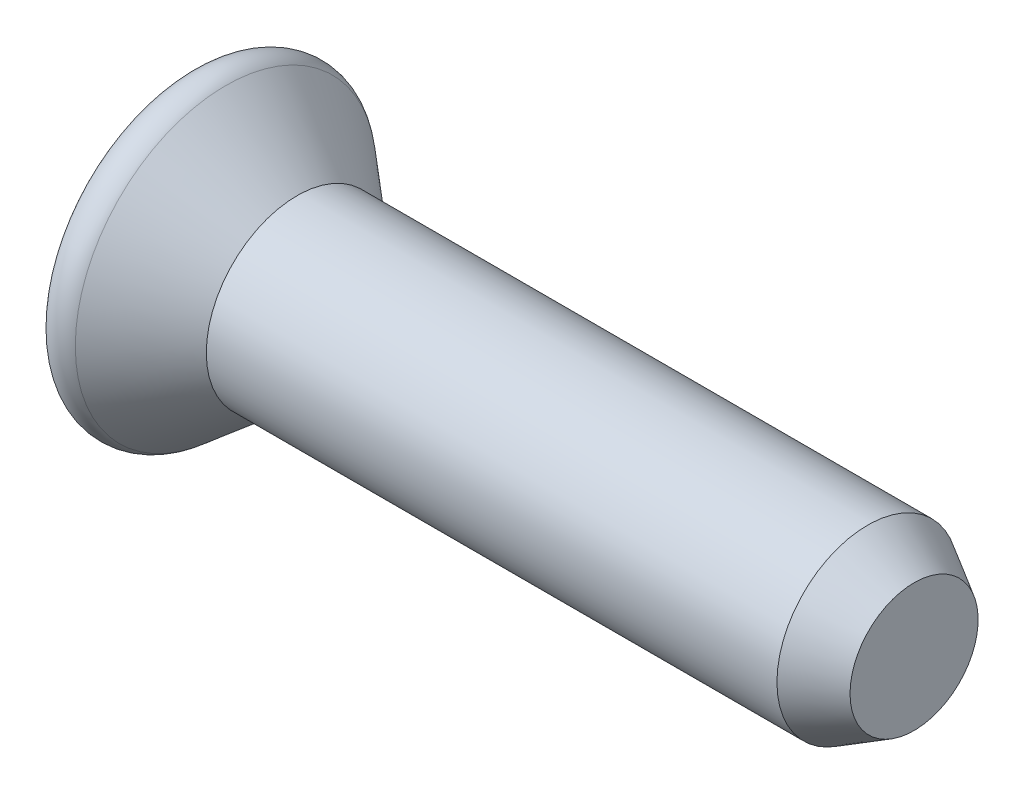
ISO-10303-21;
HEADER;
FILE_DESCRIPTION(('STEP AP214'),'2;1');
FILE_NAME('part.step','',(''),(''),'','','');
FILE_SCHEMA(('AUTOMOTIVE_DESIGN { 1 0 10303 214 1 1 1 1 }'));
ENDSEC;
DATA;
#1=APPLICATION_CONTEXT('core data for automotive mechanical design processes');
#2=APPLICATION_PROTOCOL_DEFINITION('international standard','automotive_design',2000,#1);
#3=PRODUCT_CONTEXT('',#1,'mechanical');
#4=PRODUCT('Part','Part','',(#3));
#5=PRODUCT_RELATED_PRODUCT_CATEGORY('part','',(#4));
#6=PRODUCT_DEFINITION_FORMATION('','',#4);
#7=PRODUCT_DEFINITION_CONTEXT('part definition',#1,'design');
#8=PRODUCT_DEFINITION('design','',#6,#7);
#9=PRODUCT_DEFINITION_SHAPE('','',#8);
#10=(LENGTH_UNIT() NAMED_UNIT(*) SI_UNIT(.MILLI.,.METRE.));
#11=(NAMED_UNIT(*) PLANE_ANGLE_UNIT() SI_UNIT($,.RADIAN.));
#12=(NAMED_UNIT(*) SI_UNIT($,.STERADIAN.) SOLID_ANGLE_UNIT());
#13=UNCERTAINTY_MEASURE_WITH_UNIT(LENGTH_MEASURE(1.E-05),#10,'distance_accuracy_value','');
#14=(GEOMETRIC_REPRESENTATION_CONTEXT(3) GLOBAL_UNCERTAINTY_ASSIGNED_CONTEXT((#13)) GLOBAL_UNIT_ASSIGNED_CONTEXT((#10,
#11,#12)) REPRESENTATION_CONTEXT('',''));
#15=CARTESIAN_POINT('',(0.,0.,0.));
#16=DIRECTION('',(0.,0.,1.));
#17=DIRECTION('',(1.,0.,0.));
#18=AXIS2_PLACEMENT_3D('',#15,#16,#17);
#19=CARTESIAN_POINT('',(0.,0.,0.));
#20=DIRECTION('',(-1.,0.,0.));
#21=DIRECTION('',(0.,0.,1.));
#22=AXIS2_PLACEMENT_3D('',#19,#20,#21);
#23=CYLINDRICAL_SURFACE('',#22,1.4224);
#24=CARTESIAN_POINT('',(1.4478,0.,0.));
#25=DIRECTION('',(-1.,0.,0.));
#26=DIRECTION('',(0.,0.,1.));
#27=AXIS2_PLACEMENT_3D('',#24,#25,#26);
#28=CIRCLE('',#27,1.4224);
#29=CARTESIAN_POINT('',(1.4478,0.,1.4224));
#30=VERTEX_POINT('',#29);
#31=EDGE_CURVE('E228',#30,#30,#28,.T.);
#32=ORIENTED_EDGE('',*,*,#31,.F.);
#33=EDGE_LOOP('',(#32));
#34=FACE_BOUND('',#33,.T.);
#35=CARTESIAN_POINT('',(10.3865975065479,0.,0.));
#36=DIRECTION('',(-1.,0.,0.));
#37=DIRECTION('',(0.,0.,1.));
#38=AXIS2_PLACEMENT_3D('',#35,#36,#37);
#39=CIRCLE('',#38,1.4224);
#40=CARTESIAN_POINT('',(10.3865975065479,0.,1.4224));
#41=VERTEX_POINT('',#40);
#42=EDGE_CURVE('E553',#41,#41,#39,.T.);
#43=ORIENTED_EDGE('',*,*,#42,.T.);
#44=EDGE_LOOP('',(#43));
#45=FACE_BOUND('',#44,.T.);
#46=ADVANCED_FACE('F68',(#34,#45),#23,.T.);
#47=CARTESIAN_POINT('',(4.35276934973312,0.,0.));
#48=DIRECTION('',(-1.,0.,0.));
#49=DIRECTION('',(0.,1.,0.));
#50=AXIS2_PLACEMENT_3D('',#47,#48,#49);
#51=SPHERICAL_SURFACE('',#50,5.08936934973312);
#52=CARTESIAN_POINT('',(-0.215709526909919,0.,0.));
#53=DIRECTION('',(-1.,0.,0.));
#54=DIRECTION('',(0.,0.,1.));
#55=AXIS2_PLACEMENT_3D('',#52,#53,#54);
#56=CIRCLE('',#55,2.24291799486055);
#57=CARTESIAN_POINT('',(-0.215709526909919,0.,2.24291799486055));
#58=VERTEX_POINT('',#57);
#59=EDGE_CURVE('E221',#58,#58,#56,.T.);
#60=ORIENTED_EDGE('',*,*,#59,.T.);
#61=EDGE_LOOP('',(#60));
#62=FACE_BOUND('',#61,.T.);
#63=CARTESIAN_POINT('',(4.35276934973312,-0.2413,0.));
#64=DIRECTION('',(0.,1.,0.));
#65=DIRECTION('',(0.,0.,1.));
#66=AXIS2_PLACEMENT_3D('',#63,#64,#65);
#67=CIRCLE('',#66,5.08364580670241);
#68=CARTESIAN_POINT('',(-0.702005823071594,-0.2413,0.54102));
#69=VERTEX_POINT('',#68);
#70=CARTESIAN_POINT('',(-0.52777204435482,-0.2413,1.42259284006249));
#71=VERTEX_POINT('',#70);
#72=EDGE_CURVE('E241',#69,#71,#67,.T.);
#73=ORIENTED_EDGE('',*,*,#72,.F.);
#74=CARTESIAN_POINT('',(4.35276934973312,-0.39116,0.39116));
#75=DIRECTION('',(0.,-0.707106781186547,0.707106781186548));
#76=DIRECTION('',(0.,-0.707106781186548,-0.707106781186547));
#77=AXIS2_PLACEMENT_3D('',#74,#75,#76);
#78=CIRCLE('',#77,5.05921615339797);
#79=CARTESIAN_POINT('',(-0.702005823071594,-0.54102,0.2413));
#80=VERTEX_POINT('',#79);
#81=EDGE_CURVE('E189',#69,#80,#78,.T.);
#82=ORIENTED_EDGE('',*,*,#81,.T.);
#83=CARTESIAN_POINT('',(4.35276934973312,0.,0.2413));
#84=DIRECTION('',(0.,0.,-1.));
#85=DIRECTION('',(0.,1.,0.));
#86=AXIS2_PLACEMENT_3D('',#83,#84,#85);
#87=CIRCLE('',#86,5.08364580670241);
#88=CARTESIAN_POINT('',(-0.52777204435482,-1.42259284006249,0.2413));
#89=VERTEX_POINT('',#88);
#90=EDGE_CURVE('E198',#89,#80,#87,.T.);
#91=ORIENTED_EDGE('',*,*,#90,.F.);
#92=CARTESIAN_POINT('',(4.23906698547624,0.312394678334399,0.));
#93=DIRECTION('',(-0.342020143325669,0.939692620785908,0.));
#94=DIRECTION('',(-0.939692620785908,-0.342020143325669,0.));
#95=AXIS2_PLACEMENT_3D('',#92,#93,#94);
#96=CIRCLE('',#95,5.07849994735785);
#97=CARTESIAN_POINT('',(-0.52777204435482,-1.42259284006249,-0.2413));
#98=VERTEX_POINT('',#97);
#99=EDGE_CURVE('E247',#98,#89,#96,.T.);
#100=ORIENTED_EDGE('',*,*,#99,.F.);
#101=CARTESIAN_POINT('',(4.35276934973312,0.,-0.2413));
#102=DIRECTION('',(0.,0.,1.));
#103=DIRECTION('',(1.,0.,0.));
#104=AXIS2_PLACEMENT_3D('',#101,#102,#103);
#105=CIRCLE('',#104,5.08364580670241);
#106=CARTESIAN_POINT('',(-0.702005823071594,-0.54102,-0.2413));
#107=VERTEX_POINT('',#106);
#108=EDGE_CURVE('E237',#107,#98,#105,.T.);
#109=ORIENTED_EDGE('',*,*,#108,.F.);
#110=CARTESIAN_POINT('',(4.35276934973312,-0.39116,-0.39116));
#111=DIRECTION('',(0.,-0.707106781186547,-0.707106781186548));
#112=DIRECTION('',(0.,0.707106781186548,-0.707106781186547));
#113=AXIS2_PLACEMENT_3D('',#110,#111,#112);
#114=CIRCLE('',#113,5.05921615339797);
#115=CARTESIAN_POINT('',(-0.702005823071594,-0.2413,-0.54102));
#116=VERTEX_POINT('',#115);
#117=EDGE_CURVE('E293',#107,#116,#114,.T.);
#118=ORIENTED_EDGE('',*,*,#117,.T.);
#119=CARTESIAN_POINT('',(4.35276934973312,-0.2413,0.));
#120=DIRECTION('',(0.,1.,0.));
#121=DIRECTION('',(0.,0.,1.));
#122=AXIS2_PLACEMENT_3D('',#119,#120,#121);
#123=CIRCLE('',#122,5.08364580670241);
#124=CARTESIAN_POINT('',(-0.52777204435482,-0.2413,-1.42259284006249));
#125=VERTEX_POINT('',#124);
#126=EDGE_CURVE('E234',#125,#116,#123,.T.);
#127=ORIENTED_EDGE('',*,*,#126,.F.);
#128=CARTESIAN_POINT('',(4.23906698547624,0.,0.312394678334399));
#129=DIRECTION('',(-0.342020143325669,0.,0.939692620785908));
#130=DIRECTION('',(0.939692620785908,0.,0.342020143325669));
#131=AXIS2_PLACEMENT_3D('',#128,#129,#130);
#132=CIRCLE('',#131,5.07849994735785);
#133=CARTESIAN_POINT('',(-0.52777204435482,0.2413,-1.42259284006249));
#134=VERTEX_POINT('',#133);
#135=EDGE_CURVE('E233',#134,#125,#132,.T.);
#136=ORIENTED_EDGE('',*,*,#135,.F.);
#137=CARTESIAN_POINT('',(4.35276934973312,0.2413,0.));
#138=DIRECTION('',(0.,-1.,0.));
#139=DIRECTION('',(0.,0.,-1.));
#140=AXIS2_PLACEMENT_3D('',#137,#138,#139);
#141=CIRCLE('',#140,5.08364580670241);
#142=CARTESIAN_POINT('',(-0.702005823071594,0.2413,-0.54102));
#143=VERTEX_POINT('',#142);
#144=EDGE_CURVE('E231',#143,#134,#141,.T.);
#145=ORIENTED_EDGE('',*,*,#144,.F.);
#146=CARTESIAN_POINT('',(4.35276934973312,0.39116,-0.39116));
#147=DIRECTION('',(0.,0.707106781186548,-0.707106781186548));
#148=DIRECTION('',(0.,0.707106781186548,0.707106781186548));
#149=AXIS2_PLACEMENT_3D('',#146,#147,#148);
#150=CIRCLE('',#149,5.05921615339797);
#151=CARTESIAN_POINT('',(-0.702005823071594,0.54102,-0.2413));
#152=VERTEX_POINT('',#151);
#153=EDGE_CURVE('E304',#143,#152,#150,.T.);
#154=ORIENTED_EDGE('',*,*,#153,.T.);
#155=CARTESIAN_POINT('',(4.35276934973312,0.,-0.2413));
#156=DIRECTION('',(0.,0.,1.));
#157=DIRECTION('',(0.,-1.,0.));
#158=AXIS2_PLACEMENT_3D('',#155,#156,#157);
#159=CIRCLE('',#158,5.08364580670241);
#160=CARTESIAN_POINT('',(-0.52777204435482,1.42259284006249,-0.2413));
#161=VERTEX_POINT('',#160);
#162=EDGE_CURVE('E42',#161,#152,#159,.T.);
#163=ORIENTED_EDGE('',*,*,#162,.F.);
#164=CARTESIAN_POINT('',(4.23906698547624,-0.312394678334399,0.));
#165=DIRECTION('',(-0.342020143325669,-0.939692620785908,0.));
#166=DIRECTION('',(0.939692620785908,-0.342020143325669,0.));
#167=AXIS2_PLACEMENT_3D('',#164,#165,#166);
#168=CIRCLE('',#167,5.07849994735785);
#169=CARTESIAN_POINT('',(-0.52777204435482,1.42259284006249,0.2413));
#170=VERTEX_POINT('',#169);
#171=EDGE_CURVE('E77',#170,#161,#168,.T.);
#172=ORIENTED_EDGE('',*,*,#171,.F.);
#173=CARTESIAN_POINT('',(4.35276934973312,0.,0.2413));
#174=DIRECTION('',(0.,0.,-1.));
#175=DIRECTION('',(0.,1.,0.));
#176=AXIS2_PLACEMENT_3D('',#173,#174,#175);
#177=CIRCLE('',#176,5.08364580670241);
#178=CARTESIAN_POINT('',(-0.702005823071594,0.54102,0.2413));
#179=VERTEX_POINT('',#178);
#180=EDGE_CURVE('E238',#179,#170,#177,.T.);
#181=ORIENTED_EDGE('',*,*,#180,.F.);
#182=CARTESIAN_POINT('',(4.35276934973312,0.39116,0.39116));
#183=DIRECTION('',(0.,0.707106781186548,0.707106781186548));
#184=DIRECTION('',(0.,-0.707106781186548,0.707106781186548));
#185=AXIS2_PLACEMENT_3D('',#182,#183,#184);
#186=CIRCLE('',#185,5.05921615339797);
#187=CARTESIAN_POINT('',(-0.702005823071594,0.2413,0.54102));
#188=VERTEX_POINT('',#187);
#189=EDGE_CURVE('E310',#179,#188,#186,.T.);
#190=ORIENTED_EDGE('',*,*,#189,.T.);
#191=CARTESIAN_POINT('',(4.35276934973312,0.2413,0.));
#192=DIRECTION('',(0.,-1.,0.));
#193=DIRECTION('',(0.,0.,-1.));
#194=AXIS2_PLACEMENT_3D('',#191,#192,#193);
#195=CIRCLE('',#194,5.08364580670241);
#196=CARTESIAN_POINT('',(-0.52777204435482,0.2413,1.42259284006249));
#197=VERTEX_POINT('',#196);
#198=EDGE_CURVE('E239',#197,#188,#195,.T.);
#199=ORIENTED_EDGE('',*,*,#198,.F.);
#200=CARTESIAN_POINT('',(4.23906698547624,0.,-0.312394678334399));
#201=DIRECTION('',(-0.342020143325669,0.,-0.939692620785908));
#202=DIRECTION('',(-0.939692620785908,0.,0.342020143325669));
#203=AXIS2_PLACEMENT_3D('',#200,#201,#202);
#204=CIRCLE('',#203,5.07849994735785);
#205=EDGE_CURVE('E243',#71,#197,#204,.T.);
#206=ORIENTED_EDGE('',*,*,#205,.F.);
#207=EDGE_LOOP('',(#73,#82,#91,#100,#109,#118,#127,#136,#145,#154,#163,#172,#181,#190,#199,#206));
#208=FACE_BOUND('',#207,.T.);
#209=ADVANCED_FACE('F283',(#62,#208),#51,.T.);
#210=CARTESIAN_POINT('',(1.4478,0.,0.));
#211=DIRECTION('',(-1.,0.,0.));
#212=DIRECTION('',(0.,0.,1.));
#213=AXIS2_PLACEMENT_3D('',#210,#211,#212);
#214=CONICAL_SURFACE('',#213,1.4224,0.698131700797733);
#215=CARTESIAN_POINT('',(0.33207053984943,0.,0.));
#216=DIRECTION('',(-1.,0.,0.));
#217=DIRECTION('',(0.,0.,1.));
#218=AXIS2_PLACEMENT_3D('',#215,#216,#217);
#219=CIRCLE('',#218,2.35860817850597);
#220=CARTESIAN_POINT('',(0.33207053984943,0.,2.35860817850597));
#221=VERTEX_POINT('',#220);
#222=EDGE_CURVE('E224',#221,#221,#219,.T.);
#223=ORIENTED_EDGE('',*,*,#222,.F.);
#224=EDGE_LOOP('',(#223));
#225=FACE_BOUND('',#224,.T.);
#226=ORIENTED_EDGE('',*,*,#31,.T.);
#227=EDGE_LOOP('',(#226));
#228=FACE_BOUND('',#227,.T.);
#229=ADVANCED_FACE('F384',(#225,#228),#214,.T.);
#230=CARTESIAN_POINT('',(0.103495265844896,0.,0.));
#231=DIRECTION('',(-1.,0.,0.));
#232=DIRECTION('',(0.,0.,1.));
#233=AXIS2_PLACEMENT_3D('',#230,#231,#232);
#234=TOROIDAL_SURFACE('',#233,2.08620277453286,0.355600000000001);
#235=ORIENTED_EDGE('',*,*,#59,.F.);
#236=EDGE_LOOP('',(#235));
#237=FACE_BOUND('',#236,.T.);
#238=ORIENTED_EDGE('',*,*,#222,.T.);
#239=EDGE_LOOP('',(#238));
#240=FACE_BOUND('',#239,.T.);
#241=ADVANCED_FACE('F411',(#237,#240),#234,.T.);
#242=CARTESIAN_POINT('',(0.7112,1.4986,-0.2413));
#243=DIRECTION('',(0.,0.,1.));
#244=DIRECTION('',(0.,-1.,0.));
#245=AXIS2_PLACEMENT_3D('',#242,#243,#244);
#246=PLANE('',#245);
#247=DIRECTION('',(-1.,0.,0.));
#248=VECTOR('',#247,1.);
#249=CARTESIAN_POINT('',(1.13506808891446,0.54102,-0.2413));
#250=LINE('',#249,#248);
#251=CARTESIAN_POINT('',(0.7112,0.54102,-0.2413));
#252=VERTEX_POINT('',#251);
#253=EDGE_CURVE('E298',#252,#152,#250,.T.);
#254=ORIENTED_EDGE('',*,*,#253,.F.);
#255=DIRECTION('',(0.,1.,0.));
#256=VECTOR('',#255,1.);
#257=CARTESIAN_POINT('',(0.7112,1.4986,-0.2413));
#258=LINE('',#257,#256);
#259=CARTESIAN_POINT('',(0.7112,0.971643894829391,-0.2413));
#260=VERTEX_POINT('',#259);
#261=EDGE_CURVE('E265',#252,#260,#258,.T.);
#262=ORIENTED_EDGE('',*,*,#261,.T.);
#263=DIRECTION('',(-0.939692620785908,0.342020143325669,0.));
#264=VECTOR('',#263,1.);
#265=CARTESIAN_POINT('',(-0.7366,1.4986,-0.2413));
#266=LINE('',#265,#264);
#267=EDGE_CURVE('E225',#260,#161,#266,.T.);
#268=ORIENTED_EDGE('',*,*,#267,.T.);
#269=ORIENTED_EDGE('',*,*,#162,.T.);
#270=EDGE_LOOP('',(#254,#262,#268,#269));
#271=FACE_BOUND('',#270,.T.);
#272=ADVANCED_FACE('F346',(#271),#246,.T.);
#273=CARTESIAN_POINT('',(-0.7366,1.4986,0.));
#274=DIRECTION('',(-0.342020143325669,-0.939692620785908,0.));
#275=DIRECTION('',(0.939692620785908,-0.342020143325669,0.));
#276=AXIS2_PLACEMENT_3D('',#273,#274,#275);
#277=PLANE('',#276);
#278=ORIENTED_EDGE('',*,*,#171,.T.);
#279=ORIENTED_EDGE('',*,*,#267,.F.);
#280=DIRECTION('',(0.,0.,1.));
#281=VECTOR('',#280,1.);
#282=CARTESIAN_POINT('',(0.7112,0.97164389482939,-0.2413));
#283=LINE('',#282,#281);
#284=CARTESIAN_POINT('',(0.7112,0.971643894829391,0.2413));
#285=VERTEX_POINT('',#284);
#286=EDGE_CURVE('E262',#260,#285,#283,.T.);
#287=ORIENTED_EDGE('',*,*,#286,.T.);
#288=DIRECTION('',(-0.939692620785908,0.342020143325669,0.));
#289=VECTOR('',#288,1.);
#290=CARTESIAN_POINT('',(0.541839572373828,1.03328604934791,0.2413));
#291=LINE('',#290,#289);
#292=EDGE_CURVE('E258',#285,#170,#291,.T.);
#293=ORIENTED_EDGE('',*,*,#292,.T.);
#294=EDGE_LOOP('',(#278,#279,#287,#293));
#295=FACE_BOUND('',#294,.T.);
#296=ADVANCED_FACE('F70',(#295),#277,.T.);
#297=CARTESIAN_POINT('',(0.7112,1.4986,0.2413));
#298=DIRECTION('',(0.,0.,-1.));
#299=DIRECTION('',(0.,1.,0.));
#300=AXIS2_PLACEMENT_3D('',#297,#298,#299);
#301=PLANE('',#300);
#302=DIRECTION('',(-1.,0.,0.));
#303=VECTOR('',#302,1.);
#304=CARTESIAN_POINT('',(1.13506808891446,0.54102,0.2413));
#305=LINE('',#304,#303);
#306=CARTESIAN_POINT('',(0.7112,0.54102,0.2413));
#307=VERTEX_POINT('',#306);
#308=EDGE_CURVE('E311',#307,#179,#305,.T.);
#309=ORIENTED_EDGE('',*,*,#308,.T.);
#310=ORIENTED_EDGE('',*,*,#180,.T.);
#311=ORIENTED_EDGE('',*,*,#292,.F.);
#312=DIRECTION('',(0.,-1.,0.));
#313=VECTOR('',#312,1.);
#314=CARTESIAN_POINT('',(0.7112,1.4986,0.2413));
#315=LINE('',#314,#313);
#316=EDGE_CURVE('E264',#285,#307,#315,.T.);
#317=ORIENTED_EDGE('',*,*,#316,.T.);
#318=EDGE_LOOP('',(#309,#310,#311,#317));
#319=FACE_BOUND('',#318,.T.);
#320=ADVANCED_FACE('F337',(#319),#301,.T.);
#321=CARTESIAN_POINT('',(0.7112,0.2413,0.2413));
#322=DIRECTION('',(0.,-1.,0.));
#323=DIRECTION('',(0.,0.,-1.));
#324=AXIS2_PLACEMENT_3D('',#321,#322,#323);
#325=PLANE('',#324);
#326=DIRECTION('',(-1.,0.,0.));
#327=VECTOR('',#326,1.);
#328=CARTESIAN_POINT('',(1.13506808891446,0.2413,0.54102));
#329=LINE('',#328,#327);
#330=CARTESIAN_POINT('',(0.7112,0.2413,0.54102));
#331=VERTEX_POINT('',#330);
#332=EDGE_CURVE('E307',#331,#188,#329,.T.);
#333=ORIENTED_EDGE('',*,*,#332,.F.);
#334=DIRECTION('',(0.,0.,1.));
#335=VECTOR('',#334,1.);
#336=CARTESIAN_POINT('',(0.7112,0.2413,0.2413));
#337=LINE('',#336,#335);
#338=CARTESIAN_POINT('',(0.7112,0.2413,0.971643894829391));
#339=VERTEX_POINT('',#338);
#340=EDGE_CURVE('E273',#331,#339,#337,.T.);
#341=ORIENTED_EDGE('',*,*,#340,.T.);
#342=DIRECTION('',(-0.939692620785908,0.,0.342020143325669));
#343=VECTOR('',#342,1.);
#344=CARTESIAN_POINT('',(-0.7366,0.2413,1.4986));
#345=LINE('',#344,#343);
#346=EDGE_CURVE('E261',#339,#197,#345,.T.);
#347=ORIENTED_EDGE('',*,*,#346,.T.);
#348=ORIENTED_EDGE('',*,*,#198,.T.);
#349=EDGE_LOOP('',(#333,#341,#347,#348));
#350=FACE_BOUND('',#349,.T.);
#351=ADVANCED_FACE('F323',(#350),#325,.T.);
#352=CARTESIAN_POINT('',(-0.7366,0.,1.4986));
#353=DIRECTION('',(-0.342020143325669,0.,-0.939692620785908));
#354=DIRECTION('',(-0.939692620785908,0.,0.342020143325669));
#355=AXIS2_PLACEMENT_3D('',#352,#353,#354);
#356=PLANE('',#355);
#357=ORIENTED_EDGE('',*,*,#205,.T.);
#358=ORIENTED_EDGE('',*,*,#346,.F.);
#359=DIRECTION('',(0.,-1.,0.));
#360=VECTOR('',#359,1.);
#361=CARTESIAN_POINT('',(0.7112,-1.4986,0.971643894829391));
#362=LINE('',#361,#360);
#363=CARTESIAN_POINT('',(0.7112,-0.2413,0.971643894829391));
#364=VERTEX_POINT('',#363);
#365=EDGE_CURVE('E208',#339,#364,#362,.T.);
#366=ORIENTED_EDGE('',*,*,#365,.T.);
#367=DIRECTION('',(-0.939692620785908,0.,0.342020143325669));
#368=VECTOR('',#367,1.);
#369=CARTESIAN_POINT('',(0.945928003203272,-0.2413,0.886209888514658));
#370=LINE('',#369,#368);
#371=EDGE_CURVE('E269',#364,#71,#370,.T.);
#372=ORIENTED_EDGE('',*,*,#371,.T.);
#373=EDGE_LOOP('',(#357,#358,#366,#372));
#374=FACE_BOUND('',#373,.T.);
#375=ADVANCED_FACE('F327',(#374),#356,.T.);
#376=CARTESIAN_POINT('',(0.7112,-0.2413,0.2413));
#377=DIRECTION('',(0.,1.,0.));
#378=DIRECTION('',(0.,0.,1.));
#379=AXIS2_PLACEMENT_3D('',#376,#377,#378);
#380=PLANE('',#379);
#381=DIRECTION('',(-1.,0.,0.));
#382=VECTOR('',#381,1.);
#383=CARTESIAN_POINT('',(1.13506808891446,-0.2413,0.54102));
#384=LINE('',#383,#382);
#385=CARTESIAN_POINT('',(0.7112,-0.2413,0.54102));
#386=VERTEX_POINT('',#385);
#387=EDGE_CURVE('E187',#386,#69,#384,.T.);
#388=ORIENTED_EDGE('',*,*,#387,.T.);
#389=ORIENTED_EDGE('',*,*,#72,.T.);
#390=ORIENTED_EDGE('',*,*,#371,.F.);
#391=DIRECTION('',(0.,0.,-1.));
#392=VECTOR('',#391,1.);
#393=CARTESIAN_POINT('',(0.7112,-0.2413,0.2413));
#394=LINE('',#393,#392);
#395=EDGE_CURVE('E205',#364,#386,#394,.T.);
#396=ORIENTED_EDGE('',*,*,#395,.T.);
#397=EDGE_LOOP('',(#388,#389,#390,#396));
#398=FACE_BOUND('',#397,.T.);
#399=ADVANCED_FACE('F330',(#398),#380,.T.);
#400=CARTESIAN_POINT('',(0.7112,-0.2413,0.2413));
#401=DIRECTION('',(0.,0.,-1.));
#402=DIRECTION('',(0.,1.,0.));
#403=AXIS2_PLACEMENT_3D('',#400,#401,#402);
#404=PLANE('',#403);
#405=DIRECTION('',(-1.,0.,0.));
#406=VECTOR('',#405,1.);
#407=CARTESIAN_POINT('',(1.13506808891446,-0.54102,0.2413));
#408=LINE('',#407,#406);
#409=CARTESIAN_POINT('',(0.7112,-0.54102,0.2413));
#410=VERTEX_POINT('',#409);
#411=EDGE_CURVE('E184',#410,#80,#408,.T.);
#412=ORIENTED_EDGE('',*,*,#411,.F.);
#413=DIRECTION('',(0.,-1.,0.));
#414=VECTOR('',#413,1.);
#415=CARTESIAN_POINT('',(0.7112,-0.2413,0.2413));
#416=LINE('',#415,#414);
#417=CARTESIAN_POINT('',(0.7112,-0.971643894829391,0.2413));
#418=VERTEX_POINT('',#417);
#419=EDGE_CURVE('E195',#410,#418,#416,.T.);
#420=ORIENTED_EDGE('',*,*,#419,.T.);
#421=DIRECTION('',(-0.939692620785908,-0.342020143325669,0.));
#422=VECTOR('',#421,1.);
#423=CARTESIAN_POINT('',(-0.7366,-1.4986,0.2413));
#424=LINE('',#423,#422);
#425=EDGE_CURVE('E72',#418,#89,#424,.T.);
#426=ORIENTED_EDGE('',*,*,#425,.T.);
#427=ORIENTED_EDGE('',*,*,#90,.T.);
#428=EDGE_LOOP('',(#412,#420,#426,#427));
#429=FACE_BOUND('',#428,.T.);
#430=ADVANCED_FACE('F193',(#429),#404,.T.);
#431=CARTESIAN_POINT('',(-0.7366,-1.4986,0.));
#432=DIRECTION('',(-0.342020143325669,0.939692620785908,0.));
#433=DIRECTION('',(-0.939692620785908,-0.342020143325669,0.));
#434=AXIS2_PLACEMENT_3D('',#431,#432,#433);
#435=PLANE('',#434);
#436=ORIENTED_EDGE('',*,*,#99,.T.);
#437=ORIENTED_EDGE('',*,*,#425,.F.);
#438=DIRECTION('',(0.,0.,-1.));
#439=VECTOR('',#438,1.);
#440=CARTESIAN_POINT('',(0.7112,-0.971643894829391,-0.2413));
#441=LINE('',#440,#439);
#442=CARTESIAN_POINT('',(0.7112,-0.971643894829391,-0.2413));
#443=VERTEX_POINT('',#442);
#444=EDGE_CURVE('E204',#418,#443,#441,.T.);
#445=ORIENTED_EDGE('',*,*,#444,.T.);
#446=DIRECTION('',(-0.939692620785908,-0.342020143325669,0.));
#447=VECTOR('',#446,1.);
#448=CARTESIAN_POINT('',(0.945928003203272,-0.886209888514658,-0.2413));
#449=LINE('',#448,#447);
#450=EDGE_CURVE('E256',#443,#98,#449,.T.);
#451=ORIENTED_EDGE('',*,*,#450,.T.);
#452=EDGE_LOOP('',(#436,#437,#445,#451));
#453=FACE_BOUND('',#452,.T.);
#454=ADVANCED_FACE('F369',(#453),#435,.T.);
#455=CARTESIAN_POINT('',(0.7112,-0.2413,-0.2413));
#456=DIRECTION('',(0.,0.,1.));
#457=DIRECTION('',(1.,0.,0.));
#458=AXIS2_PLACEMENT_3D('',#455,#456,#457);
#459=PLANE('',#458);
#460=DIRECTION('',(-1.,0.,0.));
#461=VECTOR('',#460,1.);
#462=CARTESIAN_POINT('',(1.13506808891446,-0.54102,-0.2413));
#463=LINE('',#462,#461);
#464=CARTESIAN_POINT('',(0.7112,-0.54102,-0.2413));
#465=VERTEX_POINT('',#464);
#466=EDGE_CURVE('E288',#465,#107,#463,.T.);
#467=ORIENTED_EDGE('',*,*,#466,.T.);
#468=ORIENTED_EDGE('',*,*,#108,.T.);
#469=ORIENTED_EDGE('',*,*,#450,.F.);
#470=DIRECTION('',(0.,1.,0.));
#471=VECTOR('',#470,1.);
#472=CARTESIAN_POINT('',(0.7112,-0.2413,-0.2413));
#473=LINE('',#472,#471);
#474=EDGE_CURVE('E207',#443,#465,#473,.T.);
#475=ORIENTED_EDGE('',*,*,#474,.T.);
#476=EDGE_LOOP('',(#467,#468,#469,#475));
#477=FACE_BOUND('',#476,.T.);
#478=ADVANCED_FACE('F367',(#477),#459,.T.);
#479=CARTESIAN_POINT('',(0.7112,-0.2413,-1.4986));
#480=DIRECTION('',(0.,1.,0.));
#481=DIRECTION('',(0.,0.,1.));
#482=AXIS2_PLACEMENT_3D('',#479,#480,#481);
#483=PLANE('',#482);
#484=DIRECTION('',(-1.,0.,0.));
#485=VECTOR('',#484,1.);
#486=CARTESIAN_POINT('',(1.13506808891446,-0.2413,-0.54102));
#487=LINE('',#486,#485);
#488=CARTESIAN_POINT('',(0.7112,-0.2413,-0.54102));
#489=VERTEX_POINT('',#488);
#490=EDGE_CURVE('E286',#489,#116,#487,.T.);
#491=ORIENTED_EDGE('',*,*,#490,.F.);
#492=DIRECTION('',(0.,0.,-1.));
#493=VECTOR('',#492,1.);
#494=CARTESIAN_POINT('',(0.7112,-0.2413,-1.4986));
#495=LINE('',#494,#493);
#496=CARTESIAN_POINT('',(0.7112,-0.2413,-0.971643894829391));
#497=VERTEX_POINT('',#496);
#498=EDGE_CURVE('E214',#489,#497,#495,.T.);
#499=ORIENTED_EDGE('',*,*,#498,.T.);
#500=DIRECTION('',(-0.939692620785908,0.,-0.342020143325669));
#501=VECTOR('',#500,1.);
#502=CARTESIAN_POINT('',(-0.7366,-0.2413,-1.4986));
#503=LINE('',#502,#501);
#504=EDGE_CURVE('E252',#497,#125,#503,.T.);
#505=ORIENTED_EDGE('',*,*,#504,.T.);
#506=ORIENTED_EDGE('',*,*,#126,.T.);
#507=EDGE_LOOP('',(#491,#499,#505,#506));
#508=FACE_BOUND('',#507,.T.);
#509=ADVANCED_FACE('F362',(#508),#483,.T.);
#510=CARTESIAN_POINT('',(-0.7366,0.,-1.4986));
#511=DIRECTION('',(-0.342020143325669,0.,0.939692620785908));
#512=DIRECTION('',(0.939692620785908,0.,0.342020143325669));
#513=AXIS2_PLACEMENT_3D('',#510,#511,#512);
#514=PLANE('',#513);
#515=ORIENTED_EDGE('',*,*,#135,.T.);
#516=ORIENTED_EDGE('',*,*,#504,.F.);
#517=DIRECTION('',(0.,1.,0.));
#518=VECTOR('',#517,1.);
#519=CARTESIAN_POINT('',(0.7112,-1.4986,-0.971643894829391));
#520=LINE('',#519,#518);
#521=CARTESIAN_POINT('',(0.7112,0.2413,-0.971643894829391));
#522=VERTEX_POINT('',#521);
#523=EDGE_CURVE('E216',#497,#522,#520,.T.);
#524=ORIENTED_EDGE('',*,*,#523,.T.);
#525=DIRECTION('',(-0.939692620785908,0.,-0.342020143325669));
#526=VECTOR('',#525,1.);
#527=CARTESIAN_POINT('',(0.541839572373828,0.2413,-1.03328604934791));
#528=LINE('',#527,#526);
#529=EDGE_CURVE('E220',#522,#134,#528,.T.);
#530=ORIENTED_EDGE('',*,*,#529,.T.);
#531=EDGE_LOOP('',(#515,#516,#524,#530));
#532=FACE_BOUND('',#531,.T.);
#533=ADVANCED_FACE('F358',(#532),#514,.T.);
#534=CARTESIAN_POINT('',(0.7112,0.2413,-1.4986));
#535=DIRECTION('',(0.,-1.,0.));
#536=DIRECTION('',(0.,0.,-1.));
#537=AXIS2_PLACEMENT_3D('',#534,#535,#536);
#538=PLANE('',#537);
#539=DIRECTION('',(-1.,0.,0.));
#540=VECTOR('',#539,1.);
#541=CARTESIAN_POINT('',(1.13506808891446,0.2413,-0.54102));
#542=LINE('',#541,#540);
#543=CARTESIAN_POINT('',(0.7112,0.2413,-0.54102));
#544=VERTEX_POINT('',#543);
#545=EDGE_CURVE('E299',#544,#143,#542,.T.);
#546=ORIENTED_EDGE('',*,*,#545,.T.);
#547=ORIENTED_EDGE('',*,*,#144,.T.);
#548=ORIENTED_EDGE('',*,*,#529,.F.);
#549=DIRECTION('',(0.,0.,1.));
#550=VECTOR('',#549,1.);
#551=CARTESIAN_POINT('',(0.7112,0.2413,-1.4986));
#552=LINE('',#551,#550);
#553=EDGE_CURVE('E217',#522,#544,#552,.T.);
#554=ORIENTED_EDGE('',*,*,#553,.T.);
#555=EDGE_LOOP('',(#546,#547,#548,#554));
#556=FACE_BOUND('',#555,.T.);
#557=ADVANCED_FACE('F352',(#556),#538,.T.);
#558=CARTESIAN_POINT('',(0.7112,-1.4986,-0.2413));
#559=DIRECTION('',(-1.,0.,0.));
#560=DIRECTION('',(0.,0.,1.));
#561=AXIS2_PLACEMENT_3D('',#558,#559,#560);
#562=PLANE('',#561);
#563=ORIENTED_EDGE('',*,*,#419,.F.);
#564=DIRECTION('',(0.,-0.707106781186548,-0.707106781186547));
#565=VECTOR('',#564,1.);
#566=CARTESIAN_POINT('',(0.7112,-0.54102,0.2413));
#567=LINE('',#566,#565);
#568=EDGE_CURVE('E85',#386,#410,#567,.T.);
#569=ORIENTED_EDGE('',*,*,#568,.F.);
#570=ORIENTED_EDGE('',*,*,#395,.F.);
#571=ORIENTED_EDGE('',*,*,#365,.F.);
#572=ORIENTED_EDGE('',*,*,#340,.F.);
#573=DIRECTION('',(0.,-0.707106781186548,0.707106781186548));
#574=VECTOR('',#573,1.);
#575=CARTESIAN_POINT('',(0.7112,0.54102,0.2413));
#576=LINE('',#575,#574);
#577=EDGE_CURVE('E308',#307,#331,#576,.T.);
#578=ORIENTED_EDGE('',*,*,#577,.F.);
#579=ORIENTED_EDGE('',*,*,#316,.F.);
#580=ORIENTED_EDGE('',*,*,#286,.F.);
#581=ORIENTED_EDGE('',*,*,#261,.F.);
#582=DIRECTION('',(0.,0.707106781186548,0.707106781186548));
#583=VECTOR('',#582,1.);
#584=CARTESIAN_POINT('',(0.7112,0.54102,-0.2413));
#585=LINE('',#584,#583);
#586=EDGE_CURVE('E92',#544,#252,#585,.T.);
#587=ORIENTED_EDGE('',*,*,#586,.F.);
#588=ORIENTED_EDGE('',*,*,#553,.F.);
#589=ORIENTED_EDGE('',*,*,#523,.F.);
#590=ORIENTED_EDGE('',*,*,#498,.F.);
#591=DIRECTION('',(0.,0.707106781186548,-0.707106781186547));
#592=VECTOR('',#591,1.);
#593=CARTESIAN_POINT('',(0.7112,-0.54102,-0.2413));
#594=LINE('',#593,#592);
#595=EDGE_CURVE('E291',#465,#489,#594,.T.);
#596=ORIENTED_EDGE('',*,*,#595,.F.);
#597=ORIENTED_EDGE('',*,*,#474,.F.);
#598=ORIENTED_EDGE('',*,*,#444,.F.);
#599=EDGE_LOOP('',(#563,#569,#570,#571,#572,#578,#579,#580,#581,#587,#588,#589,#590,#596,#597,#598));
#600=FACE_BOUND('',#599,.T.);
#601=ADVANCED_FACE('F202',(#600),#562,.T.);
#602=CARTESIAN_POINT('',(1.13506808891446,0.54102,0.2413));
#603=DIRECTION('',(0.,0.707106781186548,0.707106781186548));
#604=DIRECTION('',(0.,-0.707106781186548,0.707106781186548));
#605=AXIS2_PLACEMENT_3D('',#602,#603,#604);
#606=PLANE('',#605);
#607=ORIENTED_EDGE('',*,*,#308,.F.);
#608=ORIENTED_EDGE('',*,*,#577,.T.);
#609=ORIENTED_EDGE('',*,*,#332,.T.);
#610=ORIENTED_EDGE('',*,*,#189,.F.);
#611=EDGE_LOOP('',(#607,#608,#609,#610));
#612=FACE_BOUND('',#611,.T.);
#613=ADVANCED_FACE('F335',(#612),#606,.F.);
#614=CARTESIAN_POINT('',(1.13506808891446,0.54102,-0.2413));
#615=DIRECTION('',(0.,0.707106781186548,-0.707106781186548));
#616=DIRECTION('',(0.,0.707106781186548,0.707106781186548));
#617=AXIS2_PLACEMENT_3D('',#614,#615,#616);
#618=PLANE('',#617);
#619=ORIENTED_EDGE('',*,*,#545,.F.);
#620=ORIENTED_EDGE('',*,*,#586,.T.);
#621=ORIENTED_EDGE('',*,*,#253,.T.);
#622=ORIENTED_EDGE('',*,*,#153,.F.);
#623=EDGE_LOOP('',(#619,#620,#621,#622));
#624=FACE_BOUND('',#623,.T.);
#625=ADVANCED_FACE('F350',(#624),#618,.F.);
#626=CARTESIAN_POINT('',(1.13506808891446,-0.54102,-0.2413));
#627=DIRECTION('',(0.,-0.707106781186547,-0.707106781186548));
#628=DIRECTION('',(0.,0.707106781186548,-0.707106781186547));
#629=AXIS2_PLACEMENT_3D('',#626,#627,#628);
#630=PLANE('',#629);
#631=ORIENTED_EDGE('',*,*,#466,.F.);
#632=ORIENTED_EDGE('',*,*,#595,.T.);
#633=ORIENTED_EDGE('',*,*,#490,.T.);
#634=ORIENTED_EDGE('',*,*,#117,.F.);
#635=EDGE_LOOP('',(#631,#632,#633,#634));
#636=FACE_BOUND('',#635,.T.);
#637=ADVANCED_FACE('F365',(#636),#630,.F.);
#638=CARTESIAN_POINT('',(1.13506808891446,-0.54102,0.2413));
#639=DIRECTION('',(0.,-0.707106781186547,0.707106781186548));
#640=DIRECTION('',(0.,-0.707106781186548,-0.707106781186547));
#641=AXIS2_PLACEMENT_3D('',#638,#639,#640);
#642=PLANE('',#641);
#643=ORIENTED_EDGE('',*,*,#387,.F.);
#644=ORIENTED_EDGE('',*,*,#568,.T.);
#645=ORIENTED_EDGE('',*,*,#411,.T.);
#646=ORIENTED_EDGE('',*,*,#81,.F.);
#647=EDGE_LOOP('',(#643,#644,#645,#646));
#648=FACE_BOUND('',#647,.T.);
#649=ADVANCED_FACE('F183',(#648),#642,.F.);
#650=CARTESIAN_POINT('',(10.3865975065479,0.,0.));
#651=DIRECTION('',(-1.,0.,0.));
#652=DIRECTION('',(0.,0.,1.));
#653=AXIS2_PLACEMENT_3D('',#650,#651,#652);
#654=CONICAL_SURFACE('',#653,1.4224,0.523598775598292);
#655=CARTESIAN_POINT('',(11.1125,0.,0.));
#656=DIRECTION('',(-1.,0.,0.));
#657=DIRECTION('',(0.,0.,1.));
#658=AXIS2_PLACEMENT_3D('',#655,#656,#657);
#659=CIRCLE('',#658,1.0033);
#660=CARTESIAN_POINT('',(11.1125,0.,1.0033));
#661=VERTEX_POINT('',#660);
#662=EDGE_CURVE('E199',#661,#661,#659,.T.);
#663=ORIENTED_EDGE('',*,*,#662,.T.);
#664=EDGE_LOOP('',(#663));
#665=FACE_BOUND('',#664,.T.);
#666=ORIENTED_EDGE('',*,*,#42,.F.);
#667=EDGE_LOOP('',(#666));
#668=FACE_BOUND('',#667,.T.);
#669=ADVANCED_FACE('F394',(#665,#668),#654,.T.);
#670=CARTESIAN_POINT('',(11.1125,1.4224,0.));
#671=DIRECTION('',(-1.,0.,0.));
#672=DIRECTION('',(0.,0.,1.));
#673=AXIS2_PLACEMENT_3D('',#670,#671,#672);
#674=PLANE('',#673);
#675=ORIENTED_EDGE('',*,*,#662,.F.);
#676=EDGE_LOOP('',(#675));
#677=FACE_BOUND('',#676,.T.);
#678=ADVANCED_FACE('F392',(#677),#674,.F.);
#679=CLOSED_SHELL('',(#46,#209,#229,#241,#272,#296,#320,#351,#375,#399,#430,#454,#478,#509,#533,
#557,#601,#613,#625,#637,#649,#669,#678));
#680=MANIFOLD_SOLID_BREP('B6',#679);
#681=ADVANCED_BREP_SHAPE_REPRESENTATION('',(#18,#680),#14);
#682=SHAPE_DEFINITION_REPRESENTATION(#9,#681);
ENDSEC;
END-ISO-10303-21;
